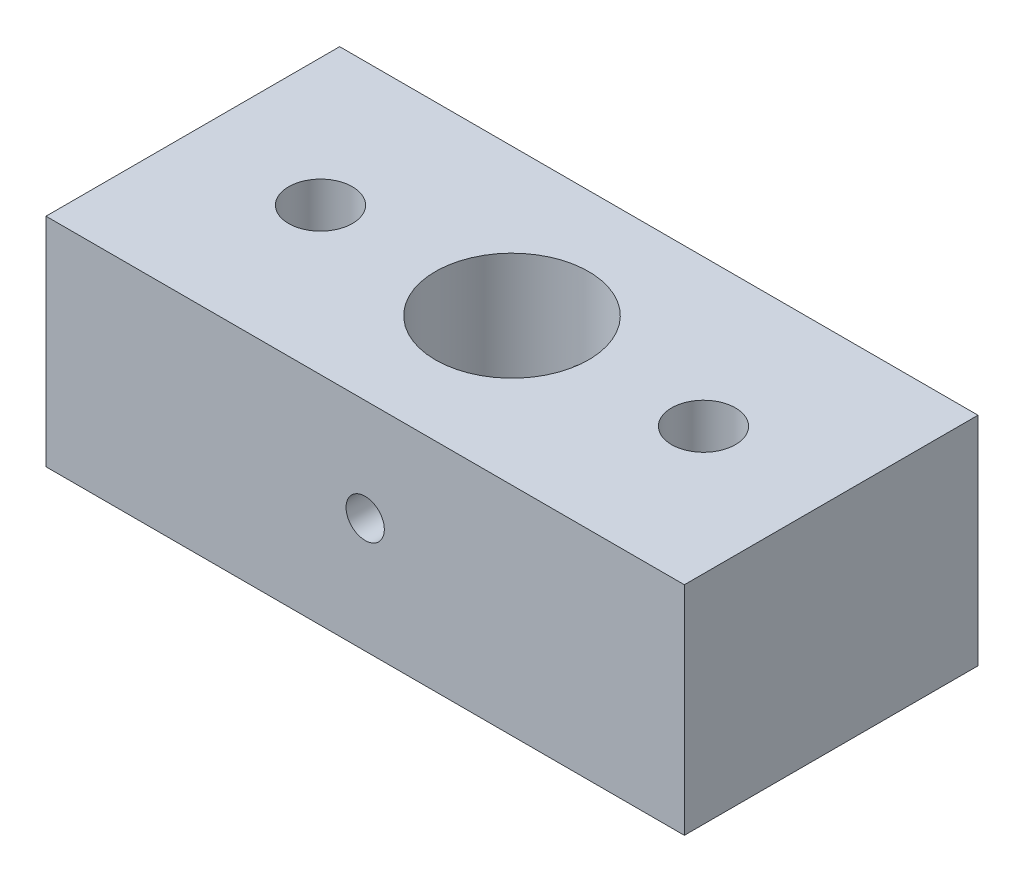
from build123d import *

# Parameters (mm, degrees)
ESQUISSE1_W             = 50
ESQUISSE1_H             = 17
BASE_EXTRUSION_DEPTH    = 23
ESQUISSE2_R             = 6
ENL_V_MAT_EXTRU_1_DEPTH = 23
TROU_TARAUD_M6X1_01_D   = 5
ESQUISSE5_R             = 1.5
ENL_V_MAT_EXTRU_2_DEPTH = 23


with BuildPart() as part:
    # Esquisse1 → Base-Extrusion (new body)
    with BuildSketch(Plane.XY):
        with Locations((32.413850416, -14.927285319)):
            Rectangle(ESQUISSE1_W, ESQUISSE1_H)
    extrude(amount=BASE_EXTRUSION_DEPTH)

    # Esquisse2 → Enl_v. mat.-Extru.1 (cut)
    with BuildSketch(Plane(origin=(0, -6.427285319, 0), x_dir=(-1, 0, 0), z_dir=(0, 1, 0))):
        with Locations(Location((-32.413850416, 11.5, 0), (0, 0, 90))):
            Circle(ESQUISSE2_R)
    extrude(amount=-ENL_V_MAT_EXTRU_1_DEPTH, mode=Mode.SUBTRACT)

    # Trou taraud_ M6x1.01 (through all)
    with Locations(Plane(origin=(0, -6.427285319, 0), x_dir=(-1, 0, 0), z_dir=(0, 1, 0))):
        with Locations((-47.413850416, 11.5), (-17.413850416, 11.5)):
            Hole(TROU_TARAUD_M6X1_01_D / 2)

    # Esquisse5 → Enl_v. mat.-Extru.2 (cut)
    with BuildSketch(Plane.XY.offset(23)):
        with Locations((32.413850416, -14.427285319)):
            Circle(ESQUISSE5_R)
    extrude(amount=-ENL_V_MAT_EXTRU_2_DEPTH, mode=Mode.SUBTRACT)


solid = part.part
